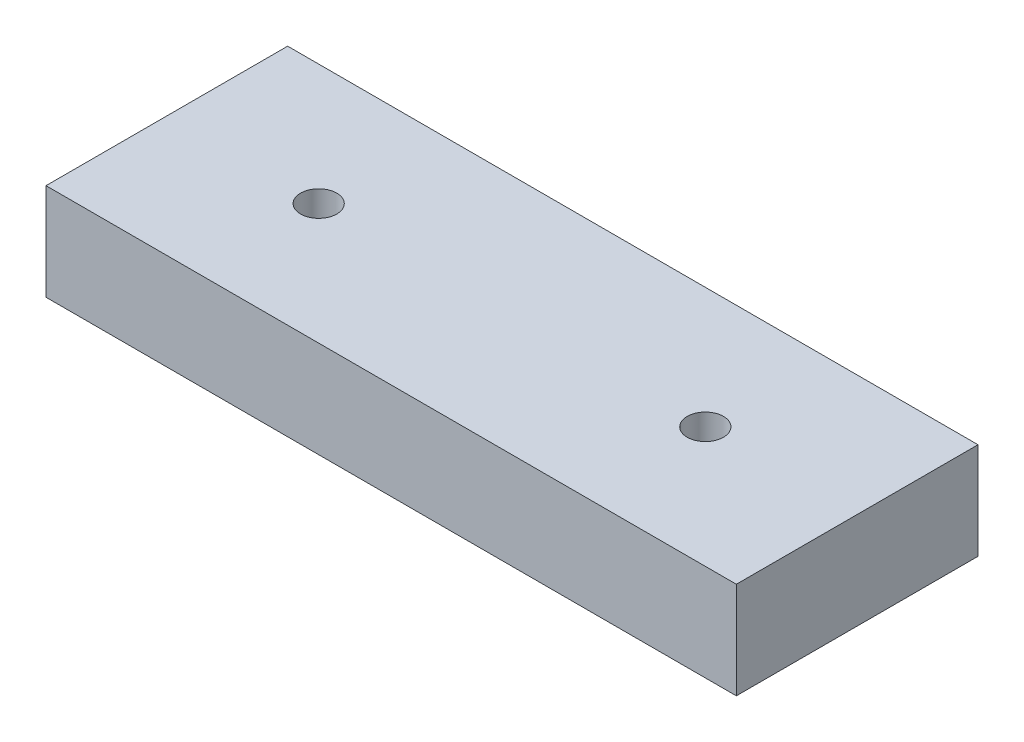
from build123d import *

# Parameters (mm, degrees)
SKETCH1_W      = 181.4068
SKETCH1_H      = 63.5
SKETCH1_R      = 4.7625
EXTRUDE1_DEPTH = 25.4


with BuildPart() as part:
    # Sketch1 → Extrude1 (new body)
    with BuildSketch(Plane(origin=(0, 0, 0), x_dir=(1, 0, 0), z_dir=(0, 1, 0))):
        Rectangle(SKETCH1_W, SKETCH1_H)
        with Locations(Location((50.8, 0, 0), (0, 0, 270))):
            Circle(SKETCH1_R, mode=Mode.SUBTRACT)
        with Locations(Location((-50.8, 0, 0), (0, 0, 270))):
            Circle(SKETCH1_R, mode=Mode.SUBTRACT)
    extrude(amount=EXTRUDE1_DEPTH)


solid = part.part
